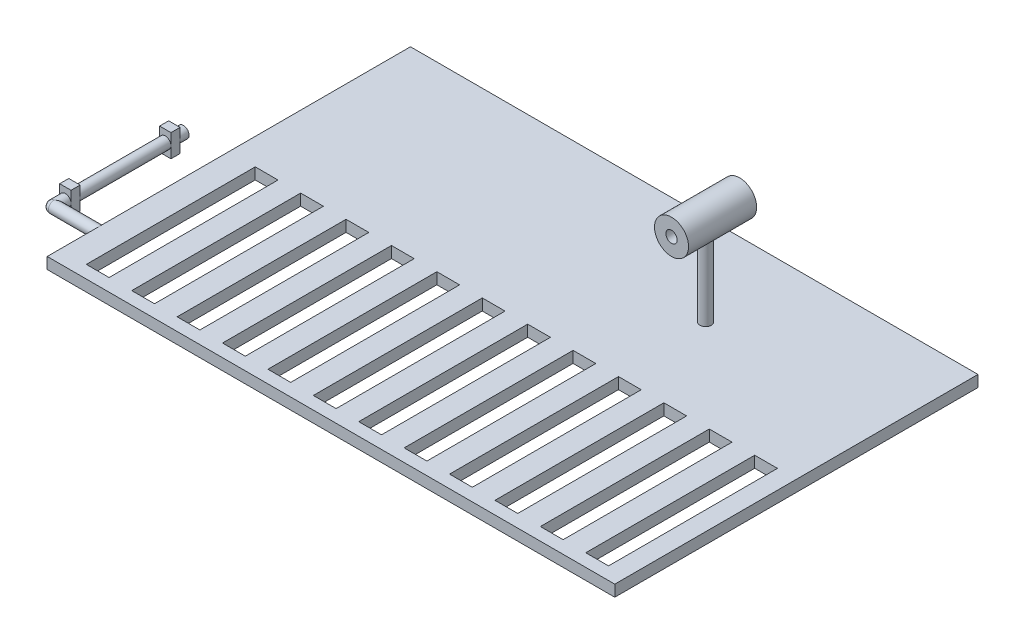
from build123d import *

# Parameters (mm, degrees)
ESQUISSE1_R             = 2.5
BASE_EXTRUSION_DEPTH    = 4
ESQUISSE2_W             = 5
ESQUISSE2_H             = 10
BOSS_EXTRU_1_DEPTH      = 4
BOSS_EXTRU_2_DEPTH      = 40
BOSS_EXTRU_3_DEPTH      = 4
BOSS_EXTRU_4_DEPTH      = 5
ESQUISSE6_R             = 2.5
BOSS_EXTRU_5_DEPTH      = 20
ESQUISSE7_W             = 160
ESQUISSE7_H             = 5
BOSS_EXTRU_6_DEPTH      = 250
ESQUISSE8_R             = 2.5
BOSS_EXTRU_7_DEPTH      = 40
BOSS_EXTRU_9_DEPTH      = 15
BOSS_EXTRU_9_DEPTH_BACK = 15
ESQUISSE10_R            = 7.5
ESQUISSE11_R            = 2.5
ENL_V_MAT_EXTRU_1_DEPTH = 30
ESQUISSE12_W            = 10.032633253
ESQUISSE12_H            = 74.408696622
ENL_V_MAT_EXTRU_2_DEPTH = 30


with BuildPart() as part:
    # Esquisse1 → Base-Extrusion (new body)
    with BuildSketch(Plane.XY):
        Circle(ESQUISSE1_R)
    extrude(amount=BASE_EXTRUSION_DEPTH)

    # Esquisse2 → Boss.-Extru.1 (add)
    with BuildSketch(Plane.XY.offset(4)):
        Rectangle(ESQUISSE2_W, ESQUISSE2_H)
    extrude(amount=BOSS_EXTRU_1_DEPTH)

    # Esquisse3 → Boss.-Extru.2 (add)
    with BuildSketch(Plane.XY.offset(8)):
        with BuildLine():
            ThreePointArc((2.5, 0), (0, 2.5), (-2.5, 0))
            ThreePointArc((-2.5, 0), (0, -2.5), (2.5, 0))
        make_face()
    extrude(amount=BOSS_EXTRU_2_DEPTH)

    # Esquisse4 → Boss.-Extru.3 (add)
    with BuildSketch(Plane.XY.offset(48)):
        Polygon((2.5, 0), (2.5, 5), (-2.5, 5), (-2.5, 0), (-2.5, -5), (2.5, -5), align=None)
    extrude(amount=BOSS_EXTRU_3_DEPTH)

    # Esquisse5 → Boss.-Extru.4 (add)
    with BuildSketch(Plane.XY.offset(52)):
        with BuildLine():
            ThreePointArc((2.5, 0), (0, 2.5), (-2.5, 0))
            ThreePointArc((-2.5, 0), (0, -2.5), (2.5, 0))
        make_face()
    extrude(amount=BOSS_EXTRU_4_DEPTH)

    # Esquisse6 → Boss.-Extru.5 (add)
    with BuildSketch(Plane(origin=(0, 0, 0), x_dir=(0, 0, -1), z_dir=(1, 0, 0))):
        with Locations(Location((-57, 0, 0), (0, 0, 270))):
            Circle(ESQUISSE6_R)
    extrude(amount=BOSS_EXTRU_5_DEPTH)

    # Esquisse7 → Boss.-Extru.6 (add)
    with BuildSketch(Plane(origin=(20, 0, 0), x_dir=(0, 0, -1), z_dir=(1, 0, 0))):
        Rectangle(ESQUISSE7_W, ESQUISSE7_H)
    extrude(amount=BOSS_EXTRU_6_DEPTH)

    # Esquisse8 → Boss.-Extru.7 (add)
    with BuildSketch(Plane(origin=(0, 2.5, 0), x_dir=(-1, 0, 0), z_dir=(0, 1, 0))):
        with Locations(Location((-190, -40, 0), (0, 0, 270))):
            Circle(ESQUISSE8_R)
    extrude(amount=BOSS_EXTRU_7_DEPTH)

    # Esquisse10 → Boss.-Extru.9 (add, two sides: drawn at the far end of the back side and taken through both)
    with BuildSketch(Plane(origin=(0, 0, -40), x_dir=(-1, 0, 0), z_dir=(0, 0, -1)).offset(-BOSS_EXTRU_9_DEPTH_BACK)):
        with Locations((-190, 42.5)):
            Circle(ESQUISSE10_R)
    extrude(amount=BOSS_EXTRU_9_DEPTH + BOSS_EXTRU_9_DEPTH_BACK)

    # Esquisse11 → Enl_v. mat.-Extru.1 (cut)
    with BuildSketch(Plane.XY.offset(-25)):
        with Locations((190, 42.5)):
            Circle(ESQUISSE11_R)
    extrude(amount=-ENL_V_MAT_EXTRU_1_DEPTH, mode=Mode.SUBTRACT)

    # Esquisse12 → Enl_v. mat.-Extru.2 (cut)
    with BuildSketch(Plane(origin=(0, 2.5, 0), x_dir=(-1, 0, 0), z_dir=(0, 1, 0))):
        with Locations((-236.649757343, 37.204348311)):
            Rectangle(ESQUISSE12_W, ESQUISSE12_H)
        with Locations((-256.649757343, 37.204348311)):
            Rectangle(ESQUISSE12_W, ESQUISSE12_H)
        with Locations((-216.649757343, 37.204348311)):
            Rectangle(ESQUISSE12_W, ESQUISSE12_H)
        with Locations((-196.649757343, 37.204348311)):
            Rectangle(ESQUISSE12_W, ESQUISSE12_H)
        with Locations((-176.649757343, 37.204348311)):
            Rectangle(ESQUISSE12_W, ESQUISSE12_H)
        with Locations((-156.649757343, 37.204348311)):
            Rectangle(ESQUISSE12_W, ESQUISSE12_H)
        with Locations((-136.649757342, 37.204348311)):
            Rectangle(ESQUISSE12_W, ESQUISSE12_H)
        with Locations((-116.649757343, 37.204348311)):
            Rectangle(ESQUISSE12_W, ESQUISSE12_H)
        with Locations((-96.649757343, 37.204348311)):
            Rectangle(ESQUISSE12_W, ESQUISSE12_H)
        with Locations((-76.649757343, 37.204348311)):
            Rectangle(ESQUISSE12_W, ESQUISSE12_H)
        with Locations((-56.649757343, 37.204348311)):
            Rectangle(ESQUISSE12_W, ESQUISSE12_H)
        with Locations((-36.649757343, 37.204348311)):
            Rectangle(ESQUISSE12_W, ESQUISSE12_H)
    extrude(amount=-ENL_V_MAT_EXTRU_2_DEPTH, mode=Mode.SUBTRACT)

    # Esquisse13 → R_volution1 (revolve)
    with BuildSketch(Plane.XY.offset(57)):
        with BuildLine():
            Line((0, -2.5), (0, 2.5))
            ThreePointArc((0, 2.5), (-2.5, 0), (0, -2.5))
        make_face()
    revolve(axis=Axis((0, 5.71843175, 57), (0, -1, 0)))


solid = part.part
